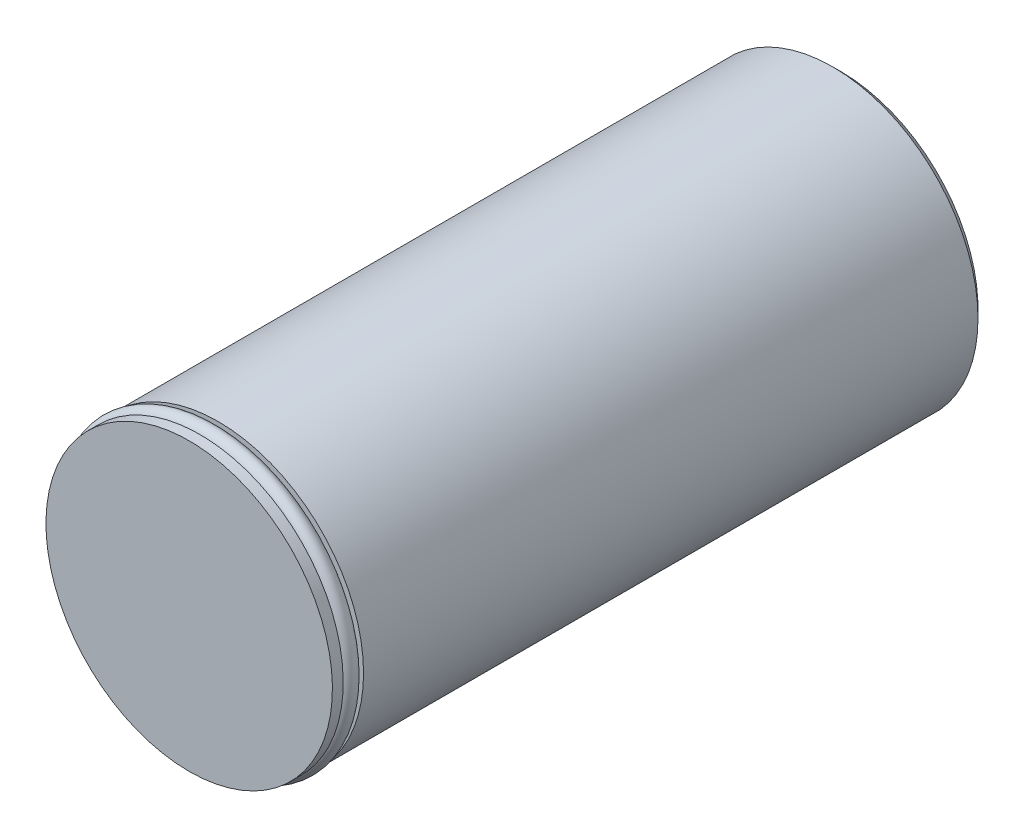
ISO-10303-21;
HEADER;
FILE_DESCRIPTION(('STEP AP214'),'2;1');
FILE_NAME('part.step','',(''),(''),'','','');
FILE_SCHEMA(('AUTOMOTIVE_DESIGN { 1 0 10303 214 1 1 1 1 }'));
ENDSEC;
DATA;
#1=APPLICATION_CONTEXT('core data for automotive mechanical design processes');
#2=APPLICATION_PROTOCOL_DEFINITION('international standard','automotive_design',2000,#1);
#3=PRODUCT_CONTEXT('',#1,'mechanical');
#4=PRODUCT('Part','Part','',(#3));
#5=PRODUCT_RELATED_PRODUCT_CATEGORY('part','',(#4));
#6=PRODUCT_DEFINITION_FORMATION('','',#4);
#7=PRODUCT_DEFINITION_CONTEXT('part definition',#1,'design');
#8=PRODUCT_DEFINITION('design','',#6,#7);
#9=PRODUCT_DEFINITION_SHAPE('','',#8);
#10=(LENGTH_UNIT() NAMED_UNIT(*) SI_UNIT(.MILLI.,.METRE.));
#11=(NAMED_UNIT(*) PLANE_ANGLE_UNIT() SI_UNIT($,.RADIAN.));
#12=(NAMED_UNIT(*) SI_UNIT($,.STERADIAN.) SOLID_ANGLE_UNIT());
#13=UNCERTAINTY_MEASURE_WITH_UNIT(LENGTH_MEASURE(1.E-05),#10,'distance_accuracy_value','');
#14=(GEOMETRIC_REPRESENTATION_CONTEXT(3) GLOBAL_UNCERTAINTY_ASSIGNED_CONTEXT((#13)) GLOBAL_UNIT_ASSIGNED_CONTEXT((#10,
#11,#12)) REPRESENTATION_CONTEXT('',''));
#15=CARTESIAN_POINT('',(0.,0.,0.));
#16=DIRECTION('',(0.,0.,1.));
#17=DIRECTION('',(1.,0.,0.));
#18=AXIS2_PLACEMENT_3D('',#15,#16,#17);
#19=CARTESIAN_POINT('',(0.,0.,75.));
#20=DIRECTION('',(0.,0.,1.));
#21=DIRECTION('',(0.,1.,0.));
#22=AXIS2_PLACEMENT_3D('',#19,#20,#21);
#23=CYLINDRICAL_SURFACE('',#22,15.8);
#24=CARTESIAN_POINT('',(0.,0.,75.2));
#25=DIRECTION('',(0.,0.,-1.));
#26=DIRECTION('',(-1.,0.,0.));
#27=AXIS2_PLACEMENT_3D('',#24,#25,#26);
#28=CIRCLE('',#27,15.8);
#29=CARTESIAN_POINT('',(-15.8,0.,75.2));
#30=VERTEX_POINT('',#29);
#31=EDGE_CURVE('E38',#30,#30,#28,.T.);
#32=ORIENTED_EDGE('',*,*,#31,.T.);
#33=EDGE_LOOP('',(#32));
#34=FACE_BOUND('',#33,.T.);
#35=CARTESIAN_POINT('',(0.,0.,75.));
#36=DIRECTION('',(0.,0.,-1.));
#37=DIRECTION('',(0.,-1.,0.));
#38=AXIS2_PLACEMENT_3D('',#35,#36,#37);
#39=CIRCLE('',#38,15.8);
#40=CARTESIAN_POINT('',(0.,-15.8,75.));
#41=VERTEX_POINT('',#40);
#42=EDGE_CURVE('E47',#41,#41,#39,.T.);
#43=ORIENTED_EDGE('',*,*,#42,.F.);
#44=EDGE_LOOP('',(#43));
#45=FACE_BOUND('',#44,.T.);
#46=ADVANCED_FACE('F34',(#34,#45),#23,.T.);
#47=CARTESIAN_POINT('',(0.,0.,24.));
#48=DIRECTION('',(0.,0.,-1.));
#49=DIRECTION('',(0.,-1.,0.));
#50=AXIS2_PLACEMENT_3D('',#47,#48,#49);
#51=PLANE('',#50);
#52=CARTESIAN_POINT('',(0.,0.,24.));
#53=DIRECTION('',(0.,0.,-1.));
#54=DIRECTION('',(0.,-1.,0.));
#55=AXIS2_PLACEMENT_3D('',#52,#53,#54);
#56=CIRCLE('',#55,8.);
#57=CARTESIAN_POINT('',(0.,-8.,24.));
#58=VERTEX_POINT('',#57);
#59=EDGE_CURVE('E52',#58,#58,#56,.T.);
#60=ORIENTED_EDGE('',*,*,#59,.T.);
#61=EDGE_LOOP('',(#60));
#62=FACE_BOUND('',#61,.T.);
#63=ADVANCED_FACE('F74',(#62),#51,.T.);
#64=CARTESIAN_POINT('',(0.,0.,24.));
#65=DIRECTION('',(0.,0.,-1.));
#66=DIRECTION('',(0.,-1.,0.));
#67=AXIS2_PLACEMENT_3D('',#64,#65,#66);
#68=CYLINDRICAL_SURFACE('',#67,8.);
#69=ORIENTED_EDGE('',*,*,#59,.F.);
#70=EDGE_LOOP('',(#69));
#71=FACE_BOUND('',#70,.T.);
#72=CARTESIAN_POINT('',(0.,0.,0.));
#73=DIRECTION('',(0.,0.,-1.));
#74=DIRECTION('',(0.,-1.,0.));
#75=AXIS2_PLACEMENT_3D('',#72,#73,#74);
#76=CIRCLE('',#75,8.);
#77=CARTESIAN_POINT('',(0.,-8.,0.));
#78=VERTEX_POINT('',#77);
#79=EDGE_CURVE('E56',#78,#78,#76,.T.);
#80=ORIENTED_EDGE('',*,*,#79,.T.);
#81=EDGE_LOOP('',(#80));
#82=FACE_BOUND('',#81,.T.);
#83=ADVANCED_FACE('F81',(#71,#82),#68,.F.);
#84=CARTESIAN_POINT('',(0.,0.,0.));
#85=DIRECTION('',(0.,0.,-1.));
#86=DIRECTION('',(0.,-1.,0.));
#87=AXIS2_PLACEMENT_3D('',#84,#85,#86);
#88=PLANE('',#87);
#89=ORIENTED_EDGE('',*,*,#79,.F.);
#90=EDGE_LOOP('',(#89));
#91=FACE_BOUND('',#90,.T.);
#92=CARTESIAN_POINT('',(0.,0.,0.));
#93=DIRECTION('',(0.,0.,-1.));
#94=DIRECTION('',(0.,-1.,0.));
#95=AXIS2_PLACEMENT_3D('',#92,#93,#94);
#96=CIRCLE('',#95,16.5);
#97=CARTESIAN_POINT('',(0.,-16.5,0.));
#98=VERTEX_POINT('',#97);
#99=EDGE_CURVE('E61',#98,#98,#96,.T.);
#100=ORIENTED_EDGE('',*,*,#99,.T.);
#101=EDGE_LOOP('',(#100));
#102=FACE_BOUND('',#101,.T.);
#103=ADVANCED_FACE('F92',(#91,#102),#88,.T.);
#104=CARTESIAN_POINT('',(0.,0.,0.));
#105=DIRECTION('',(0.,0.,1.));
#106=DIRECTION('',(0.,1.,0.));
#107=AXIS2_PLACEMENT_3D('',#104,#105,#106);
#108=CONICAL_SURFACE('',#107,16.5,0.785398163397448);
#109=CARTESIAN_POINT('',(0.,0.,1.));
#110=DIRECTION('',(0.,0.,-1.));
#111=DIRECTION('',(0.,-1.,0.));
#112=AXIS2_PLACEMENT_3D('',#109,#110,#111);
#113=CIRCLE('',#112,17.5);
#114=CARTESIAN_POINT('',(0.,-17.5,1.));
#115=VERTEX_POINT('',#114);
#116=EDGE_CURVE('E63',#115,#115,#113,.F.);
#117=ORIENTED_EDGE('',*,*,#116,.F.);
#118=EDGE_LOOP('',(#117));
#119=FACE_BOUND('',#118,.T.);
#120=ORIENTED_EDGE('',*,*,#99,.F.);
#121=EDGE_LOOP('',(#120));
#122=FACE_BOUND('',#121,.T.);
#123=ADVANCED_FACE('F36',(#119,#122),#108,.T.);
#124=CARTESIAN_POINT('',(0.,0.,0.));
#125=DIRECTION('',(0.,0.,1.));
#126=DIRECTION('',(0.,1.,0.));
#127=AXIS2_PLACEMENT_3D('',#124,#125,#126);
#128=CYLINDRICAL_SURFACE('',#127,17.5);
#129=ORIENTED_EDGE('',*,*,#116,.T.);
#130=EDGE_LOOP('',(#129));
#131=FACE_BOUND('',#130,.T.);
#132=CARTESIAN_POINT('',(0.,0.,75.));
#133=DIRECTION('',(0.,0.,-1.));
#134=DIRECTION('',(0.,-1.,0.));
#135=AXIS2_PLACEMENT_3D('',#132,#133,#134);
#136=CIRCLE('',#135,17.5);
#137=CARTESIAN_POINT('',(0.,-17.5,75.));
#138=VERTEX_POINT('',#137);
#139=EDGE_CURVE('E55',#138,#138,#136,.T.);
#140=ORIENTED_EDGE('',*,*,#139,.T.);
#141=EDGE_LOOP('',(#140));
#142=FACE_BOUND('',#141,.T.);
#143=ADVANCED_FACE('F90',(#131,#142),#128,.T.);
#144=CARTESIAN_POINT('',(0.,0.,75.));
#145=DIRECTION('',(0.,0.,-1.));
#146=DIRECTION('',(0.,-1.,0.));
#147=AXIS2_PLACEMENT_3D('',#144,#145,#146);
#148=PLANE('',#147);
#149=ORIENTED_EDGE('',*,*,#42,.T.);
#150=EDGE_LOOP('',(#149));
#151=FACE_BOUND('',#150,.T.);
#152=ORIENTED_EDGE('',*,*,#139,.F.);
#153=EDGE_LOOP('',(#152));
#154=FACE_BOUND('',#153,.T.);
#155=ADVANCED_FACE('F70',(#151,#154),#148,.F.);
#156=CARTESIAN_POINT('',(0.,0.,76.2));
#157=DIRECTION('',(0.,0.,-1.));
#158=DIRECTION('',(-1.,0.,0.));
#159=AXIS2_PLACEMENT_3D('',#156,#157,#158);
#160=TOROIDAL_SURFACE('',#159,16.75,1.);
#161=CARTESIAN_POINT('',(0.,0.,75.2));
#162=DIRECTION('',(0.,0.,-1.));
#163=DIRECTION('',(-1.,0.,0.));
#164=AXIS2_PLACEMENT_3D('',#161,#162,#163);
#165=CIRCLE('',#164,16.75);
#166=CARTESIAN_POINT('',(-16.75,0.,75.2));
#167=VERTEX_POINT('',#166);
#168=EDGE_CURVE('E127',#167,#167,#165,.T.);
#169=ORIENTED_EDGE('',*,*,#168,.F.);
#170=EDGE_LOOP('',(#169));
#171=FACE_BOUND('',#170,.T.);
#172=CARTESIAN_POINT('',(0.,0.,77.2));
#173=DIRECTION('',(0.,0.,-1.));
#174=DIRECTION('',(-1.,0.,0.));
#175=AXIS2_PLACEMENT_3D('',#172,#173,#174);
#176=CIRCLE('',#175,16.75);
#177=CARTESIAN_POINT('',(-16.75,0.,77.2));
#178=VERTEX_POINT('',#177);
#179=EDGE_CURVE('E125',#178,#178,#176,.T.);
#180=ORIENTED_EDGE('',*,*,#179,.T.);
#181=EDGE_LOOP('',(#180));
#182=FACE_BOUND('',#181,.T.);
#183=ADVANCED_FACE('F77',(#171,#182),#160,.T.);
#184=CARTESIAN_POINT('',(0.,0.,75.2));
#185=DIRECTION('',(0.,0.,-1.));
#186=DIRECTION('',(-1.,0.,0.));
#187=AXIS2_PLACEMENT_3D('',#184,#185,#186);
#188=PLANE('',#187);
#189=ORIENTED_EDGE('',*,*,#31,.F.);
#190=EDGE_LOOP('',(#189));
#191=FACE_BOUND('',#190,.T.);
#192=ORIENTED_EDGE('',*,*,#168,.T.);
#193=EDGE_LOOP('',(#192));
#194=FACE_BOUND('',#193,.T.);
#195=ADVANCED_FACE('F88',(#191,#194),#188,.T.);
#196=CARTESIAN_POINT('',(0.,0.,78.5));
#197=DIRECTION('',(0.,0.,-1.));
#198=DIRECTION('',(0.,-1.,0.));
#199=AXIS2_PLACEMENT_3D('',#196,#197,#198);
#200=PLANE('',#199);
#201=CARTESIAN_POINT('',(0.,0.,78.5));
#202=DIRECTION('',(0.,0.,-1.));
#203=DIRECTION('',(0.,-1.,0.));
#204=AXIS2_PLACEMENT_3D('',#201,#202,#203);
#205=CIRCLE('',#204,17.25);
#206=CARTESIAN_POINT('',(0.,-17.25,78.5));
#207=VERTEX_POINT('',#206);
#208=EDGE_CURVE('E42',#207,#207,#205,.T.);
#209=ORIENTED_EDGE('',*,*,#208,.F.);
#210=EDGE_LOOP('',(#209));
#211=FACE_BOUND('',#210,.T.);
#212=ADVANCED_FACE('F115',(#211),#200,.F.);
#213=CARTESIAN_POINT('',(0.,0.,77.2));
#214=DIRECTION('',(0.,0.,1.));
#215=DIRECTION('',(0.,1.,0.));
#216=AXIS2_PLACEMENT_3D('',#213,#214,#215);
#217=CYLINDRICAL_SURFACE('',#216,17.25);
#218=CARTESIAN_POINT('',(0.,0.,77.2));
#219=DIRECTION('',(0.,0.,-1.));
#220=DIRECTION('',(0.,-1.,0.));
#221=AXIS2_PLACEMENT_3D('',#218,#219,#220);
#222=CIRCLE('',#221,17.25);
#223=CARTESIAN_POINT('',(0.,-17.25,77.2));
#224=VERTEX_POINT('',#223);
#225=EDGE_CURVE('E10',#224,#224,#222,.T.);
#226=ORIENTED_EDGE('',*,*,#225,.F.);
#227=EDGE_LOOP('',(#226));
#228=FACE_BOUND('',#227,.T.);
#229=ORIENTED_EDGE('',*,*,#208,.T.);
#230=EDGE_LOOP('',(#229));
#231=FACE_BOUND('',#230,.T.);
#232=ADVANCED_FACE('F111',(#228,#231),#217,.T.);
#233=CARTESIAN_POINT('',(0.,0.,77.2));
#234=DIRECTION('',(0.,0.,-1.));
#235=DIRECTION('',(0.,-1.,0.));
#236=AXIS2_PLACEMENT_3D('',#233,#234,#235);
#237=PLANE('',#236);
#238=ORIENTED_EDGE('',*,*,#179,.F.);
#239=EDGE_LOOP('',(#238));
#240=FACE_BOUND('',#239,.T.);
#241=ORIENTED_EDGE('',*,*,#225,.T.);
#242=EDGE_LOOP('',(#241));
#243=FACE_BOUND('',#242,.T.);
#244=ADVANCED_FACE('F114',(#240,#243),#237,.T.);
#245=CLOSED_SHELL('',(#46,#63,#83,#103,#123,#143,#155,#183,#195,#212,#232,#244));
#246=MANIFOLD_SOLID_BREP('B2',#245);
#247=ADVANCED_BREP_SHAPE_REPRESENTATION('',(#18,#246),#14);
#248=SHAPE_DEFINITION_REPRESENTATION(#9,#247);
ENDSEC;
END-ISO-10303-21;
